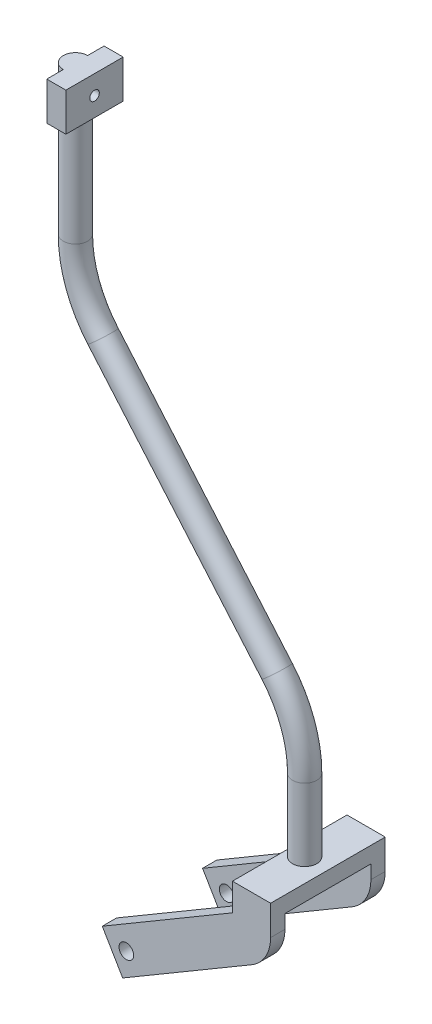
ISO-10303-21;
HEADER;
FILE_DESCRIPTION(('STEP AP214'),'2;1');
FILE_NAME('part.step','',(''),(''),'','','');
FILE_SCHEMA(('AUTOMOTIVE_DESIGN { 1 0 10303 214 1 1 1 1 }'));
ENDSEC;
DATA;
#1=APPLICATION_CONTEXT('core data for automotive mechanical design processes');
#2=APPLICATION_PROTOCOL_DEFINITION('international standard','automotive_design',2000,#1);
#3=PRODUCT_CONTEXT('',#1,'mechanical');
#4=PRODUCT('Part','Part','',(#3));
#5=PRODUCT_RELATED_PRODUCT_CATEGORY('part','',(#4));
#6=PRODUCT_DEFINITION_FORMATION('','',#4);
#7=PRODUCT_DEFINITION_CONTEXT('part definition',#1,'design');
#8=PRODUCT_DEFINITION('design','',#6,#7);
#9=PRODUCT_DEFINITION_SHAPE('','',#8);
#10=(LENGTH_UNIT() NAMED_UNIT(*) SI_UNIT(.MILLI.,.METRE.));
#11=(NAMED_UNIT(*) PLANE_ANGLE_UNIT() SI_UNIT($,.RADIAN.));
#12=(NAMED_UNIT(*) SI_UNIT($,.STERADIAN.) SOLID_ANGLE_UNIT());
#13=UNCERTAINTY_MEASURE_WITH_UNIT(LENGTH_MEASURE(1.E-05),#10,'distance_accuracy_value','');
#14=(GEOMETRIC_REPRESENTATION_CONTEXT(3) GLOBAL_UNCERTAINTY_ASSIGNED_CONTEXT((#13)) GLOBAL_UNIT_ASSIGNED_CONTEXT((#10,
#11,#12)) REPRESENTATION_CONTEXT('',''));
#15=CARTESIAN_POINT('',(0.,0.,0.));
#16=DIRECTION('',(0.,0.,1.));
#17=DIRECTION('',(1.,0.,0.));
#18=AXIS2_PLACEMENT_3D('',#15,#16,#17);
#19=CARTESIAN_POINT('',(0.,-197.623570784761,0.));
#20=DIRECTION('',(0.,1.,0.));
#21=DIRECTION('',(-1.,0.,0.));
#22=AXIS2_PLACEMENT_3D('',#19,#20,#21);
#23=CYLINDRICAL_SURFACE('',#22,16.132175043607);
#24=CARTESIAN_POINT('',(-16.132175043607,-31.75,0.));
#25=CARTESIAN_POINT('',(-16.1321741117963,-31.7499987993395,0.170971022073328));
#26=CARTESIAN_POINT('',(-16.1294496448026,-31.7430859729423,0.34199774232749));
#27=CARTESIAN_POINT('',(-16.1186199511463,-31.7154963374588,0.682840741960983));
#28=CARTESIAN_POINT('',(-16.1105113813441,-31.6948109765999,0.852656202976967));
#29=CARTESIAN_POINT('',(-16.0891075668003,-31.6398279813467,1.19009348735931));
#30=CARTESIAN_POINT('',(-16.0758019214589,-31.6055030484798,1.35771021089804));
#31=CARTESIAN_POINT('',(-16.0443510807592,-31.5235659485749,1.68926495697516));
#32=CARTESIAN_POINT('',(-16.0262039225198,-31.4759483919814,1.85320145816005));
#33=CARTESIAN_POINT('',(-15.9856172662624,-31.3680712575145,2.17564341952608));
#34=CARTESIAN_POINT('',(-15.9631934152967,-31.3078576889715,2.33416626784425));
#35=CARTESIAN_POINT('',(-15.9145667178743,-31.1751772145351,2.64546177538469));
#36=CARTESIAN_POINT('',(-15.8883624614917,-31.1027057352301,2.79823226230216));
#37=CARTESIAN_POINT('',(-15.8328450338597,-30.9461483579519,3.09695913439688));
#38=CARTESIAN_POINT('',(-15.8035341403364,-30.8620709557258,3.24292040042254));
#39=CARTESIAN_POINT('',(-15.7424809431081,-30.682824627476,3.5273985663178));
#40=CARTESIAN_POINT('',(-15.71073776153,-30.5876516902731,3.66591274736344));
#41=CARTESIAN_POINT('',(-15.6442235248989,-30.382664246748,3.94031643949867));
#42=CARTESIAN_POINT('',(-15.6093814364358,-30.2724052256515,4.07585678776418));
#43=CARTESIAN_POINT('',(-15.5387743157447,-30.0412334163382,4.33726865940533));
#44=CARTESIAN_POINT('',(-15.5030092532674,-29.9203202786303,4.46313986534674));
#45=CARTESIAN_POINT('',(-15.4314560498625,-29.668471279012,4.70458302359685));
#46=CARTESIAN_POINT('',(-15.3956679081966,-29.5375293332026,4.82014863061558));
#47=CARTESIAN_POINT('',(-15.3250451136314,-29.2664647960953,5.04017986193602));
#48=CARTESIAN_POINT('',(-15.2902101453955,-29.126345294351,5.1446491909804));
#49=CARTESIAN_POINT('',(-15.2209598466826,-28.8313948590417,5.34614739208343));
#50=CARTESIAN_POINT('',(-15.1866280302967,-28.6761896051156,5.4426580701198));
#51=CARTESIAN_POINT('',(-15.1210992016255,-28.3575928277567,5.62214904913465));
#52=CARTESIAN_POINT('',(-15.089900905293,-28.1942046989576,5.70513490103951));
#53=CARTESIAN_POINT('',(-15.0316419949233,-27.8602277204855,5.85691249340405));
#54=CARTESIAN_POINT('',(-15.0045817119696,-27.689638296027,5.92570309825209));
#55=CARTESIAN_POINT('',(-14.9555541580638,-27.3425543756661,6.04837495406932));
#56=CARTESIAN_POINT('',(-14.9335843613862,-27.1660628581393,6.10226360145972));
#57=CARTESIAN_POINT('',(-14.8963610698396,-26.8162976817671,6.19255834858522));
#58=CARTESIAN_POINT('',(-14.8808554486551,-26.6432219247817,6.22962706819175));
#59=CARTESIAN_POINT('',(-14.8557716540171,-26.2942309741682,6.28921054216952));
#60=CARTESIAN_POINT('',(-14.8461908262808,-26.1183170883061,6.31173181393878));
#61=CARTESIAN_POINT('',(-14.8332956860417,-25.7650263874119,6.34197779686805));
#62=CARTESIAN_POINT('',(-14.8299801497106,-25.5876498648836,6.34970539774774));
#63=CARTESIAN_POINT('',(-14.8297350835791,-25.2328723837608,6.35027802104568));
#64=CARTESIAN_POINT('',(-14.8328052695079,-25.0554714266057,6.34312370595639));
#65=CARTESIAN_POINT('',(-14.8447975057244,-24.7140146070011,6.3150034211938));
#66=CARTESIAN_POINT('',(-14.8533118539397,-24.5498640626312,6.294999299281));
#67=CARTESIAN_POINT('',(-14.8755272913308,-24.2239102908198,6.24232137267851));
#68=CARTESIAN_POINT('',(-14.8892300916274,-24.0621078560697,6.20964338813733));
#69=CARTESIAN_POINT('',(-14.9213971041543,-23.7420271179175,6.13194454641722));
#70=CARTESIAN_POINT('',(-14.9398601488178,-23.5837479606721,6.08692671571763));
#71=CARTESIAN_POINT('',(-14.9810120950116,-23.2715962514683,5.98492859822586));
#72=CARTESIAN_POINT('',(-15.0037026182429,-23.1177254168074,5.92794371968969));
#73=CARTESIAN_POINT('',(-15.0531483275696,-22.8123658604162,5.80125060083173));
#74=CARTESIAN_POINT('',(-15.0799746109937,-22.6609833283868,5.73131438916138));
#75=CARTESIAN_POINT('',(-15.1366179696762,-22.3645746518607,5.57999938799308));
#76=CARTESIAN_POINT('',(-15.1664360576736,-22.2195506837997,5.4986167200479));
#77=CARTESIAN_POINT('',(-15.2282740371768,-21.9366465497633,5.32496331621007));
#78=CARTESIAN_POINT('',(-15.2602942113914,-21.7987673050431,5.23269118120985));
#79=CARTESIAN_POINT('',(-15.3257290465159,-21.5308557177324,5.0378233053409));
#80=CARTESIAN_POINT('',(-15.3591437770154,-21.4008237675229,4.93522704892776));
#81=CARTESIAN_POINT('',(-15.4290855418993,-21.139826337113,4.71222300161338));
#82=CARTESIAN_POINT('',(-15.4656582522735,-21.0095202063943,4.59105672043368));
#83=CARTESIAN_POINT('',(-15.5384773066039,-20.7595255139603,4.33821339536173));
#84=CARTESIAN_POINT('',(-15.574723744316,-20.6398338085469,4.20653948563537));
#85=CARTESIAN_POINT('',(-15.6459563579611,-20.4117006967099,3.93332663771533));
#86=CARTESIAN_POINT('',(-15.6809418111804,-20.3032656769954,3.79178217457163));
#87=CARTESIAN_POINT('',(-15.7486862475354,-20.0985021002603,3.49977229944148));
#88=CARTESIAN_POINT('',(-15.7814461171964,-20.0021687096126,3.34931048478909));
#89=CARTESIAN_POINT('',(-15.8444723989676,-19.8205621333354,3.03736105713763));
#90=CARTESIAN_POINT('',(-15.8746792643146,-19.7355352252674,2.87571778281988));
#91=CARTESIAN_POINT('',(-15.9310141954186,-19.5795246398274,2.54518159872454));
#92=CARTESIAN_POINT('',(-15.9571438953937,-19.5085353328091,2.37629162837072));
#93=CARTESIAN_POINT('',(-16.0045742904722,-19.3812529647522,2.03243349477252));
#94=CARTESIAN_POINT('',(-16.0258758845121,-19.3249571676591,1.85746647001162));
#95=CARTESIAN_POINT('',(-16.0630178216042,-19.227642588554,1.50276972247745));
#96=CARTESIAN_POINT('',(-16.0788585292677,-19.1866227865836,1.3230403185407));
#97=CARTESIAN_POINT('',(-16.1038529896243,-19.1222348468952,0.970750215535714));
#98=CARTESIAN_POINT('',(-16.113339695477,-19.0979851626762,0.798373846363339));
#99=CARTESIAN_POINT('',(-16.1267727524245,-19.0637173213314,0.452000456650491));
#100=CARTESIAN_POINT('',(-16.1307193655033,-19.0536984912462,0.278003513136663));
#101=CARTESIAN_POINT('',(-16.1329616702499,-19.0480013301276,-0.0702234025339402));
#102=CARTESIAN_POINT('',(-16.1312585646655,-19.0523199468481,-0.244453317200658));
#103=CARTESIAN_POINT('',(-16.1222517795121,-19.0752437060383,-0.591822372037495));
#104=CARTESIAN_POINT('',(-16.1149482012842,-19.0938485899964,-0.764961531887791));
#105=CARTESIAN_POINT('',(-16.0953803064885,-19.1440266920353,-1.10133943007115));
#106=CARTESIAN_POINT('',(-16.083345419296,-19.1750010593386,-1.26468138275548));
#107=CARTESIAN_POINT('',(-16.0546370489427,-19.2495542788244,-1.58810136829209));
#108=CARTESIAN_POINT('',(-16.0379620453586,-19.2931372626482,-1.74817831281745));
#109=CARTESIAN_POINT('',(-16.000390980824,-19.3925002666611,-2.06393683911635));
#110=CARTESIAN_POINT('',(-15.9794960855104,-19.448276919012,-2.21961962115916));
#111=CARTESIAN_POINT('',(-15.9339763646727,-19.5715941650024,-2.52575314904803));
#112=CARTESIAN_POINT('',(-15.9093501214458,-19.6391392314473,-2.67620187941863));
#113=CARTESIAN_POINT('',(-15.8561657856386,-19.78765900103,-2.97537364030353));
#114=CARTESIAN_POINT('',(-15.8275120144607,-19.8689753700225,-3.12390999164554));
#115=CARTESIAN_POINT('',(-15.767554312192,-20.0429609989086,-3.41367904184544));
#116=CARTESIAN_POINT('',(-15.7362494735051,-20.1356341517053,-3.5549092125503));
#117=CARTESIAN_POINT('',(-15.6717428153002,-20.3317140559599,-3.82928383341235));
#118=CARTESIAN_POINT('',(-15.6385406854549,-20.435122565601,-3.96242695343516));
#119=CARTESIAN_POINT('',(-15.5710333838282,-20.652039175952,-4.21991824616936));
#120=CARTESIAN_POINT('',(-15.536728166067,-20.7655476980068,-4.34426605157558));
#121=CARTESIAN_POINT('',(-15.4656208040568,-21.0096305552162,-4.59120868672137));
#122=CARTESIAN_POINT('',(-15.4287997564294,-21.1408326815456,-4.71317840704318));
#123=CARTESIAN_POINT('',(-15.3558605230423,-21.4131366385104,-4.94565061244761));
#124=CARTESIAN_POINT('',(-15.3197421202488,-21.5542353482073,-5.05615668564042));
#125=CARTESIAN_POINT('',(-15.2491991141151,-21.8456375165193,-5.26508928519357));
#126=CARTESIAN_POINT('',(-15.2147754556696,-21.9959460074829,-5.36350911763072));
#127=CARTESIAN_POINT('',(-15.1486767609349,-22.304750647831,-5.54745124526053));
#128=CARTESIAN_POINT('',(-15.1170005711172,-22.46324331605,-5.6329789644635));
#129=CARTESIAN_POINT('',(-15.0571098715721,-22.7889051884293,-5.79117729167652));
#130=CARTESIAN_POINT('',(-15.0289276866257,-22.9561376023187,-5.86373024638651));
#131=CARTESIAN_POINT('',(-14.9773060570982,-23.296799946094,-5.99435657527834));
#132=CARTESIAN_POINT('',(-14.9538645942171,-23.4702272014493,-6.05243611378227));
#133=CARTESIAN_POINT('',(-14.9125501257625,-23.8220040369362,-6.15352793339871));
#134=CARTESIAN_POINT('',(-14.8946750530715,-24.0003517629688,-6.19654580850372));
#135=CARTESIAN_POINT('',(-14.8651511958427,-24.3605968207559,-6.26704228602));
#136=CARTESIAN_POINT('',(-14.8535019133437,-24.5424938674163,-6.29452213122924));
#137=CARTESIAN_POINT('',(-14.8374610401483,-24.8954647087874,-6.33223550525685));
#138=CARTESIAN_POINT('',(-14.832618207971,-25.0664040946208,-6.34354230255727));
#139=CARTESIAN_POINT('',(-14.8288693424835,-25.4087003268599,-6.35230122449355));
#140=CARTESIAN_POINT('',(-14.8299630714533,-25.580057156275,-6.34975390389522));
#141=CARTESIAN_POINT('',(-14.8380491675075,-25.9218428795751,-6.3308350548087));
#142=CARTESIAN_POINT('',(-14.8450408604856,-26.0922718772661,-6.3144651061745));
#143=CARTESIAN_POINT('',(-14.8646833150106,-26.4309298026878,-6.26808534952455));
#144=CARTESIAN_POINT('',(-14.877334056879,-26.5991587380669,-6.23807558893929));
#145=CARTESIAN_POINT('',(-14.9073025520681,-26.925970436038,-6.1661056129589));
#146=CARTESIAN_POINT('',(-14.9244283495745,-27.0846788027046,-6.12463359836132));
#147=CARTESIAN_POINT('',(-14.9630313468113,-27.3979779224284,-6.02970881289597));
#148=CARTESIAN_POINT('',(-14.9845099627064,-27.5525673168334,-5.9762521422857));
#149=CARTESIAN_POINT('',(-15.0312066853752,-27.8566581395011,-5.8578105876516));
#150=CARTESIAN_POINT('',(-15.0564242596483,-28.0061602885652,-5.79282734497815));
#151=CARTESIAN_POINT('',(-15.1099230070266,-28.2993116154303,-5.65181241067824));
#152=CARTESIAN_POINT('',(-15.1382052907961,-28.442958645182,-5.57577671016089));
#153=CARTESIAN_POINT('',(-15.2298542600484,-28.8796042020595,-5.32277811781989));
#154=CARTESIAN_POINT('',(-15.2973150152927,-29.1613769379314,-5.12747701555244));
#155=CARTESIAN_POINT('',(-15.4356400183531,-29.6894763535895,-4.69462873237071));
#156=CARTESIAN_POINT('',(-15.5065054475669,-29.9357906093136,-4.45706680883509));
#157=CARTESIAN_POINT('',(-15.6122119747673,-30.281559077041,-4.06519740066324));
#158=CARTESIAN_POINT('',(-15.6483793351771,-30.3957622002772,-3.92401318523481));
#159=CARTESIAN_POINT('',(-15.7187029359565,-30.6118606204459,-3.63207286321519));
#160=CARTESIAN_POINT('',(-15.7528598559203,-30.713760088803,-3.48132002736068));
#161=CARTESIAN_POINT('',(-15.8182297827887,-30.9045306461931,-3.17109198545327));
#162=CARTESIAN_POINT('',(-15.8494415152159,-30.9933961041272,-3.01161305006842));
#163=CARTESIAN_POINT('',(-15.9080222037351,-31.1572961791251,-2.68503374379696));
#164=CARTESIAN_POINT('',(-15.9353916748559,-31.232332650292,-2.51793439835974));
#165=CARTESIAN_POINT('',(-15.9833694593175,-31.3621175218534,-2.19175632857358));
#166=CARTESIAN_POINT('',(-16.004354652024,-31.4180480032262,-2.03320242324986));
#167=CARTESIAN_POINT('',(-16.0419260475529,-31.5172649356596,-1.71168474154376));
#168=CARTESIAN_POINT('',(-16.0585127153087,-31.5605527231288,-1.54872143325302));
#169=CARTESIAN_POINT('',(-16.0868326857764,-31.6340002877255,-1.21986228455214));
#170=CARTESIAN_POINT('',(-16.0985774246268,-31.6641910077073,-1.05397433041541));
#171=CARTESIAN_POINT('',(-16.1169608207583,-31.7112858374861,-0.720111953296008));
#172=CARTESIAN_POINT('',(-16.1236025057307,-31.7281978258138,-0.552138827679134));
#173=CARTESIAN_POINT('',(-16.1291302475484,-31.7422612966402,-0.319877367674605));
#174=CARTESIAN_POINT('',(-16.1302713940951,-31.7451624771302,-0.255945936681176));
#175=CARTESIAN_POINT('',(-16.1317939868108,-31.7490321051,-0.128012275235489));
#176=CARTESIAN_POINT('',(-16.1321753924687,-31.7500004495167,-0.0640100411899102));
#177=CARTESIAN_POINT('',(-16.132175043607,-31.75,0.));
#178=B_SPLINE_CURVE_WITH_KNOTS('',3,(#24,#25,#26,#27,#28,#29,#30,#31,#32,#33,#34,#35,#36,#37,
#38,#39,#40,#41,#42,#43,#44,#45,#46,#47,#48,#49,#50,#51,#52,#53,#54,#55,#56,#57,#58,#59,#60,#61,
#62,#63,#64,#65,#66,#67,#68,#69,#70,#71,#72,#73,#74,#75,#76,#77,#78,#79,#80,#81,#82,#83,#84,#85,
#86,#87,#88,#89,#90,#91,#92,#93,#94,#95,#96,#97,#98,#99,#100,#101,#102,#103,#104,#105,#106,#107,
#108,#109,#110,#111,#112,#113,#114,#115,#116,#117,#118,#119,#120,#121,#122,#123,#124,#125,#126,
#127,#128,#129,#130,#131,#132,#133,#134,#135,#136,#137,#138,#139,#140,#141,#142,#143,#144,#145,
#146,#147,#148,#149,#150,#151,#152,#153,#154,#155,#156,#157,#158,#159,#160,#161,#162,#163,#164,
#165,#166,#167,#168,#169,#170,#171,#172,#173,#174,#175,#176,#177),.UNSPECIFIED.,.T.,.F.,(4,2,2,
2,2,2,2,2,2,2,2,2,2,2,2,2,2,2,2,2,2,2,2,2,2,2,2,2,2,2,2,2,2,2,2,2,2,2,2,2,2,2,2,2,2,2,2,2,2,2,2,
2,2,2,2,2,2,2,2,2,2,2,2,2,2,2,2,2,2,2,2,2,2,2,2,2,4),(0.,0.512849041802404,1.02601682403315,
1.5402168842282,2.05462573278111,2.56718742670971,3.07994078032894,3.59232076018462,
4.10488654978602,4.63878483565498,5.1727006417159,5.70694294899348,6.24100632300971,
6.79819962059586,7.35516365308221,7.91217222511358,8.46890383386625,9.00123897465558,
9.53333545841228,10.0653279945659,10.5972968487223,11.0934670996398,11.5898011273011,
12.0860135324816,12.5824166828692,13.0885722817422,13.5948997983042,14.101292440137,
14.6077103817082,15.1520533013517,15.6962344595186,16.2407227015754,16.7849927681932,
17.3396541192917,17.894092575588,18.4484277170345,19.0027258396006,19.5250575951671,
20.0473646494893,20.5695605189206,21.0917469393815,21.5912353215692,22.0908875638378,
22.590401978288,23.0901066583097,23.6047794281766,24.1196291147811,24.6345632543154,
25.14951888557,25.697536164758,26.24538139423,26.7935286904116,27.3414447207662,
27.8941017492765,28.446522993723,28.9987388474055,29.5509105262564,30.064402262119,
30.5778734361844,31.0912859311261,31.6046966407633,32.0989319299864,32.5933282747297,
33.0876542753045,33.5821600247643,34.6256209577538,35.6694466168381,36.2243525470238,
36.7790698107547,37.3340260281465,37.8889077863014,38.3966442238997,38.9043269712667,
39.4108036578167,39.9169796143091,40.1089755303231,40.3009816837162),.UNSPECIFIED.);
#179=CARTESIAN_POINT('',(-16.132175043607,-31.75,0.));
#180=VERTEX_POINT('',#179);
#181=EDGE_CURVE('E192',#180,#180,#178,.T.);
#182=ORIENTED_EDGE('',*,*,#181,.F.);
#183=EDGE_LOOP('',(#182));
#184=FACE_BOUND('',#183,.T.);
#185=CARTESIAN_POINT('',(0.,-197.623570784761,0.));
#186=DIRECTION('',(0.,1.,0.));
#187=DIRECTION('',(0.,0.,1.));
#188=AXIS2_PLACEMENT_3D('',#185,#186,#187);
#189=CIRCLE('',#188,16.132175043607);
#190=CARTESIAN_POINT('',(-16.1321750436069,-197.623570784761,0.));
#191=VERTEX_POINT('',#190);
#192=EDGE_CURVE('E334',#191,#191,#189,.T.);
#193=ORIENTED_EDGE('',*,*,#192,.T.);
#194=EDGE_LOOP('',(#193));
#195=FACE_BOUND('',#194,.T.);
#196=CARTESIAN_POINT('',(0.,0.,0.));
#197=DIRECTION('',(0.,1.,0.));
#198=DIRECTION('',(0.,0.,1.));
#199=AXIS2_PLACEMENT_3D('',#196,#197,#198);
#200=CIRCLE('',#199,16.132175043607);
#201=CARTESIAN_POINT('',(0.,0.,-16.132175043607));
#202=VERTEX_POINT('',#201);
#203=CARTESIAN_POINT('',(0.,0.,16.132175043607));
#204=VERTEX_POINT('',#203);
#205=EDGE_CURVE('E331',#202,#204,#200,.T.);
#206=ORIENTED_EDGE('',*,*,#205,.F.);
#207=DIRECTION('',(0.,1.,0.));
#208=VECTOR('',#207,1.);
#209=CARTESIAN_POINT('',(0.,-197.623570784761,-16.132175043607));
#210=LINE('',#209,#208);
#211=CARTESIAN_POINT('',(0.,-50.8,-16.132175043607));
#212=VERTEX_POINT('',#211);
#213=EDGE_CURVE('E221',#202,#212,#210,.F.);
#214=ORIENTED_EDGE('',*,*,#213,.T.);
#215=CARTESIAN_POINT('',(0.,-50.8,0.));
#216=DIRECTION('',(0.,1.,0.));
#217=DIRECTION('',(0.,0.,1.));
#218=AXIS2_PLACEMENT_3D('',#215,#216,#217);
#219=CIRCLE('',#218,16.132175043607);
#220=CARTESIAN_POINT('',(0.,-50.8,16.132175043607));
#221=VERTEX_POINT('',#220);
#222=EDGE_CURVE('E11',#212,#221,#219,.F.);
#223=ORIENTED_EDGE('',*,*,#222,.T.);
#224=DIRECTION('',(0.,1.,0.));
#225=VECTOR('',#224,1.);
#226=CARTESIAN_POINT('',(0.,-197.623570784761,16.132175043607));
#227=LINE('',#226,#225);
#228=EDGE_CURVE('E173',#221,#204,#227,.T.);
#229=ORIENTED_EDGE('',*,*,#228,.T.);
#230=EDGE_LOOP('',(#206,#214,#223,#229));
#231=FACE_BOUND('',#230,.T.);
#232=ADVANCED_FACE('F33',(#184,#195,#231),#23,.T.);
#233=CARTESIAN_POINT('',(284.899081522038,-798.47194558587,76.2));
#234=DIRECTION('',(-0.507484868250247,0.86166066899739,0.));
#235=DIRECTION('',(-0.86166066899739,-0.507484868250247,0.));
#236=AXIS2_PLACEMENT_3D('',#233,#234,#235);
#237=PLANE('',#236);
#238=DIRECTION('',(0.86166066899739,0.507484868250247,0.));
#239=VECTOR('',#238,1.);
#240=CARTESIAN_POINT('',(284.899081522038,-798.47194558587,57.15));
#241=LINE('',#240,#239);
#242=CARTESIAN_POINT('',(111.878780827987,-900.374222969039,57.15));
#243=VERTEX_POINT('',#242);
#244=CARTESIAN_POINT('',(284.899081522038,-798.47194558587,57.15));
#245=VERTEX_POINT('',#244);
#246=EDGE_CURVE('E254',#243,#245,#241,.T.);
#247=ORIENTED_EDGE('',*,*,#246,.F.);
#248=DIRECTION('',(0.,0.,-1.));
#249=VECTOR('',#248,1.);
#250=CARTESIAN_POINT('',(111.878780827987,-900.374222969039,76.2));
#251=LINE('',#250,#249);
#252=CARTESIAN_POINT('',(111.878780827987,-900.374222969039,76.2));
#253=VERTEX_POINT('',#252);
#254=EDGE_CURVE('E295',#253,#243,#251,.T.);
#255=ORIENTED_EDGE('',*,*,#254,.F.);
#256=DIRECTION('',(0.86166066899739,0.507484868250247,0.));
#257=VECTOR('',#256,1.);
#258=CARTESIAN_POINT('',(284.899081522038,-798.47194558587,76.2));
#259=LINE('',#258,#257);
#260=CARTESIAN_POINT('',(284.899081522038,-798.47194558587,76.2));
#261=VERTEX_POINT('',#260);
#262=EDGE_CURVE('E286',#253,#261,#259,.T.);
#263=ORIENTED_EDGE('',*,*,#262,.T.);
#264=DIRECTION('',(0.,0.,-1.));
#265=VECTOR('',#264,1.);
#266=CARTESIAN_POINT('',(284.899081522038,-798.47194558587,76.2));
#267=LINE('',#266,#265);
#268=EDGE_CURVE('E290',#261,#245,#267,.T.);
#269=ORIENTED_EDGE('',*,*,#268,.T.);
#270=EDGE_LOOP('',(#247,#255,#263,#269));
#271=FACE_BOUND('',#270,.T.);
#272=ADVANCED_FACE('F389',(#271),#237,.T.);
#273=CARTESIAN_POINT('',(111.878780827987,-900.374222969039,76.2));
#274=DIRECTION('',(-0.86166066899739,-0.507484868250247,0.));
#275=DIRECTION('',(0.507484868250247,-0.86166066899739,0.));
#276=AXIS2_PLACEMENT_3D('',#273,#274,#275);
#277=PLANE('',#276);
#278=DIRECTION('',(-0.507484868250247,0.86166066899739,0.));
#279=VECTOR('',#278,1.);
#280=CARTESIAN_POINT('',(111.878780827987,-900.374222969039,57.15));
#281=LINE('',#280,#279);
#282=CARTESIAN_POINT('',(139.01755151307,-946.453254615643,57.15));
#283=VERTEX_POINT('',#282);
#284=EDGE_CURVE('E252',#283,#243,#281,.T.);
#285=ORIENTED_EDGE('',*,*,#284,.F.);
#286=DIRECTION('',(0.,0.,-1.));
#287=VECTOR('',#286,1.);
#288=CARTESIAN_POINT('',(139.01755151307,-946.453254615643,76.2));
#289=LINE('',#288,#287);
#290=CARTESIAN_POINT('',(139.01755151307,-946.453254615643,76.2));
#291=VERTEX_POINT('',#290);
#292=EDGE_CURVE('E299',#291,#283,#289,.T.);
#293=ORIENTED_EDGE('',*,*,#292,.F.);
#294=DIRECTION('',(-0.507484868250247,0.86166066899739,0.));
#295=VECTOR('',#294,1.);
#296=CARTESIAN_POINT('',(111.878780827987,-900.374222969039,76.2));
#297=LINE('',#296,#295);
#298=EDGE_CURVE('E283',#291,#253,#297,.T.);
#299=ORIENTED_EDGE('',*,*,#298,.T.);
#300=ORIENTED_EDGE('',*,*,#254,.T.);
#301=EDGE_LOOP('',(#285,#293,#299,#300));
#302=FACE_BOUND('',#301,.T.);
#303=ADVANCED_FACE('F386',(#302),#277,.T.);
#304=CARTESIAN_POINT('',(310.67931282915,-845.351104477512,76.2));
#305=DIRECTION('',(0.507484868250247,-0.86166066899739,0.));
#306=DIRECTION('',(0.86166066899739,0.507484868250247,0.));
#307=AXIS2_PLACEMENT_3D('',#304,#305,#306);
#308=PLANE('',#307);
#309=DIRECTION('',(-0.86166066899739,-0.507484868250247,0.));
#310=VECTOR('',#309,1.);
#311=CARTESIAN_POINT('',(310.67931282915,-845.351104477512,57.15));
#312=LINE('',#311,#310);
#313=CARTESIAN_POINT('',(310.67931282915,-845.351104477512,57.15));
#314=VERTEX_POINT('',#313);
#315=EDGE_CURVE('E250',#314,#283,#312,.T.);
#316=ORIENTED_EDGE('',*,*,#315,.F.);
#317=DIRECTION('',(0.,0.,-1.));
#318=VECTOR('',#317,1.);
#319=CARTESIAN_POINT('',(310.67931282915,-845.351104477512,76.2));
#320=LINE('',#319,#318);
#321=CARTESIAN_POINT('',(310.67931282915,-845.351104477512,76.2));
#322=VERTEX_POINT('',#321);
#323=EDGE_CURVE('E303',#322,#314,#320,.T.);
#324=ORIENTED_EDGE('',*,*,#323,.F.);
#325=DIRECTION('',(-0.86166066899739,-0.507484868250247,0.));
#326=VECTOR('',#325,1.);
#327=CARTESIAN_POINT('',(310.67931282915,-845.351104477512,76.2));
#328=LINE('',#327,#326);
#329=EDGE_CURVE('E280',#322,#291,#328,.T.);
#330=ORIENTED_EDGE('',*,*,#329,.T.);
#331=ORIENTED_EDGE('',*,*,#292,.T.);
#332=EDGE_LOOP('',(#316,#324,#330,#331));
#333=FACE_BOUND('',#332,.T.);
#334=ADVANCED_FACE('F378',(#333),#308,.T.);
#335=CARTESIAN_POINT('',(284.899081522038,-801.578742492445,76.2));
#336=DIRECTION('',(0.,0.,-1.));
#337=DIRECTION('',(-1.,0.,0.));
#338=AXIS2_PLACEMENT_3D('',#335,#336,#337);
#339=CYLINDRICAL_SURFACE('',#338,50.8);
#340=CARTESIAN_POINT('',(284.899081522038,-801.578742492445,57.15));
#341=DIRECTION('',(0.,0.,1.));
#342=DIRECTION('',(1.,0.,0.));
#343=AXIS2_PLACEMENT_3D('',#340,#341,#342);
#344=CIRCLE('',#343,50.8);
#345=CARTESIAN_POINT('',(335.699081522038,-801.578742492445,57.15));
#346=VERTEX_POINT('',#345);
#347=EDGE_CURVE('E248',#346,#314,#344,.F.);
#348=ORIENTED_EDGE('',*,*,#347,.F.);
#349=DIRECTION('',(0.,0.,-1.));
#350=VECTOR('',#349,1.);
#351=CARTESIAN_POINT('',(335.699081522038,-801.578742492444,76.2));
#352=LINE('',#351,#350);
#353=CARTESIAN_POINT('',(335.699081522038,-801.578742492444,76.2));
#354=VERTEX_POINT('',#353);
#355=EDGE_CURVE('E307',#354,#346,#352,.T.);
#356=ORIENTED_EDGE('',*,*,#355,.F.);
#357=CARTESIAN_POINT('',(284.899081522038,-801.578742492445,76.2));
#358=DIRECTION('',(0.,0.,-1.));
#359=DIRECTION('',(1.,0.,0.));
#360=AXIS2_PLACEMENT_3D('',#357,#358,#359);
#361=CIRCLE('',#360,50.8);
#362=EDGE_CURVE('E277',#354,#322,#361,.T.);
#363=ORIENTED_EDGE('',*,*,#362,.T.);
#364=ORIENTED_EDGE('',*,*,#323,.T.);
#365=EDGE_LOOP('',(#348,#356,#363,#364));
#366=FACE_BOUND('',#365,.T.);
#367=ADVANCED_FACE('F374',(#366),#339,.T.);
#368=CARTESIAN_POINT('',(143.869397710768,-913.074222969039,76.2));
#369=DIRECTION('',(0.,0.,-1.));
#370=DIRECTION('',(-1.,0.,0.));
#371=AXIS2_PLACEMENT_3D('',#368,#369,#370);
#372=CYLINDRICAL_SURFACE('',#371,9.70369239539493);
#373=CARTESIAN_POINT('',(143.869397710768,-913.074222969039,57.15));
#374=DIRECTION('',(0.,0.,1.));
#375=DIRECTION('',(1.,0.,0.));
#376=AXIS2_PLACEMENT_3D('',#373,#374,#375);
#377=CIRCLE('',#376,9.70369239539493);
#378=CARTESIAN_POINT('',(153.573090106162,-913.074222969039,57.15));
#379=VERTEX_POINT('',#378);
#380=EDGE_CURVE('E247',#379,#379,#377,.F.);
#381=ORIENTED_EDGE('',*,*,#380,.T.);
#382=EDGE_LOOP('',(#381));
#383=FACE_BOUND('',#382,.T.);
#384=CARTESIAN_POINT('',(143.869397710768,-913.074222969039,76.2));
#385=DIRECTION('',(0.,0.,-1.));
#386=DIRECTION('',(-1.,0.,0.));
#387=AXIS2_PLACEMENT_3D('',#384,#385,#386);
#388=CIRCLE('',#387,9.70369239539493);
#389=CARTESIAN_POINT('',(134.165705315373,-913.074222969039,76.2));
#390=VERTEX_POINT('',#389);
#391=EDGE_CURVE('E262',#390,#390,#388,.T.);
#392=ORIENTED_EDGE('',*,*,#391,.F.);
#393=EDGE_LOOP('',(#392));
#394=FACE_BOUND('',#393,.T.);
#395=ADVANCED_FACE('F451',(#383,#394),#372,.F.);
#396=CARTESIAN_POINT('',(304.8,-665.976429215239,0.));
#397=DIRECTION('',(0.,-1.,0.));
#398=DIRECTION('',(1.,0.,0.));
#399=AXIS2_PLACEMENT_3D('',#396,#397,#398);
#400=CYLINDRICAL_SURFACE('',#399,16.132175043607);
#401=CARTESIAN_POINT('',(304.8,-665.976429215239,0.));
#402=DIRECTION('',(0.,1.,0.));
#403=DIRECTION('',(0.,0.,1.));
#404=AXIS2_PLACEMENT_3D('',#401,#402,#403);
#405=CIRCLE('',#404,16.132175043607);
#406=CARTESIAN_POINT('',(320.932175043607,-665.976429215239,0.));
#407=VERTEX_POINT('',#406);
#408=EDGE_CURVE('E343',#407,#407,#405,.T.);
#409=ORIENTED_EDGE('',*,*,#408,.F.);
#410=EDGE_LOOP('',(#409));
#411=FACE_BOUND('',#410,.T.);
#412=CARTESIAN_POINT('',(304.8,-762.,0.));
#413=DIRECTION('',(0.,1.,0.));
#414=DIRECTION('',(0.,0.,1.));
#415=AXIS2_PLACEMENT_3D('',#412,#413,#414);
#416=CIRCLE('',#415,16.132175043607);
#417=CARTESIAN_POINT('',(304.8,-762.,16.132175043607));
#418=VERTEX_POINT('',#417);
#419=EDGE_CURVE('E330',#418,#418,#416,.T.);
#420=ORIENTED_EDGE('',*,*,#419,.T.);
#421=EDGE_LOOP('',(#420));
#422=FACE_BOUND('',#421,.T.);
#423=ADVANCED_FACE('F35',(#411,#422),#400,.T.);
#424=CARTESIAN_POINT('',(152.4,-665.976429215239,0.));
#425=DIRECTION('',(0.,0.,-1.));
#426=DIRECTION('',(-1.,0.,0.));
#427=AXIS2_PLACEMENT_3D('',#424,#425,#426);
#428=TOROIDAL_SURFACE('',#427,152.4,16.132175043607);
#429=CARTESIAN_POINT('',(268.110706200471,-566.79582390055,0.));
#430=DIRECTION('',(-0.650791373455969,0.759256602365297,0.));
#431=DIRECTION('',(0.,0.,1.));
#432=AXIS2_PLACEMENT_3D('',#429,#430,#431);
#433=CIRCLE('',#432,16.132175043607);
#434=CARTESIAN_POINT('',(280.359166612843,-556.297143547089,0.));
#435=VERTEX_POINT('',#434);
#436=EDGE_CURVE('E340',#435,#435,#433,.T.);
#437=CARTESIAN_POINT('',(152.4,-665.976429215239,0.));
#438=DIRECTION('',(0.,0.,-1.));
#439=DIRECTION('',(-1.,0.,0.));
#440=AXIS2_PLACEMENT_3D('',#437,#438,#439);
#441=CIRCLE('',#440,168.532175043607);
#442=EDGE_CURVE('',#435,#407,#441,.T.);
#443=ORIENTED_EDGE('',*,*,#436,.F.);
#444=ORIENTED_EDGE('',*,*,#408,.T.);
#445=ORIENTED_EDGE('',*,*,#442,.T.);
#446=ORIENTED_EDGE('',*,*,#442,.F.);
#447=EDGE_LOOP('',(#443,#445,#444,#446));
#448=FACE_BOUND('',#447,.T.);
#449=ADVANCED_FACE('F444',(#448),#428,.T.);
#450=CARTESIAN_POINT('',(36.6892937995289,-296.80417609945,0.));
#451=DIRECTION('',(0.650791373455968,-0.759256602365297,0.));
#452=DIRECTION('',(0.759256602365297,0.650791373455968,0.));
#453=AXIS2_PLACEMENT_3D('',#450,#451,#452);
#454=CYLINDRICAL_SURFACE('',#453,16.132175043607);
#455=CARTESIAN_POINT('',(36.6892937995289,-296.80417609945,0.));
#456=DIRECTION('',(-0.650791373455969,0.759256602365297,0.));
#457=DIRECTION('',(0.,0.,1.));
#458=AXIS2_PLACEMENT_3D('',#455,#456,#457);
#459=CIRCLE('',#458,16.132175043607);
#460=CARTESIAN_POINT('',(24.4408333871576,-307.302856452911,0.));
#461=VERTEX_POINT('',#460);
#462=EDGE_CURVE('E337',#461,#461,#459,.T.);
#463=ORIENTED_EDGE('',*,*,#462,.F.);
#464=EDGE_LOOP('',(#463));
#465=FACE_BOUND('',#464,.T.);
#466=ORIENTED_EDGE('',*,*,#436,.T.);
#467=EDGE_LOOP('',(#466));
#468=FACE_BOUND('',#467,.T.);
#469=ADVANCED_FACE('F441',(#465,#468),#454,.T.);
#470=CARTESIAN_POINT('',(152.4,-197.623570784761,0.));
#471=DIRECTION('',(0.,0.,1.));
#472=DIRECTION('',(1.,0.,0.));
#473=AXIS2_PLACEMENT_3D('',#470,#471,#472);
#474=TOROIDAL_SURFACE('',#473,152.4,16.132175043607);
#475=CARTESIAN_POINT('',(152.4,-197.623570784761,0.));
#476=DIRECTION('',(0.,0.,1.));
#477=DIRECTION('',(1.,0.,0.));
#478=AXIS2_PLACEMENT_3D('',#475,#476,#477);
#479=CIRCLE('',#478,168.532175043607);
#480=EDGE_CURVE('',#191,#461,#479,.T.);
#481=ORIENTED_EDGE('',*,*,#192,.F.);
#482=ORIENTED_EDGE('',*,*,#462,.T.);
#483=ORIENTED_EDGE('',*,*,#480,.T.);
#484=ORIENTED_EDGE('',*,*,#480,.F.);
#485=EDGE_LOOP('',(#481,#483,#482,#484));
#486=FACE_BOUND('',#485,.T.);
#487=ADVANCED_FACE('F438',(#486),#474,.T.);
#488=CARTESIAN_POINT('',(0.,0.,0.));
#489=DIRECTION('',(0.,1.,0.));
#490=DIRECTION('',(0.,0.,1.));
#491=AXIS2_PLACEMENT_3D('',#488,#489,#490);
#492=PLANE('',#491);
#493=ORIENTED_EDGE('',*,*,#205,.T.);
#494=DIRECTION('',(0.,0.,1.));
#495=VECTOR('',#494,1.);
#496=CARTESIAN_POINT('',(0.,0.,38.1));
#497=LINE('',#496,#495);
#498=CARTESIAN_POINT('',(0.,0.,38.1));
#499=VERTEX_POINT('',#498);
#500=EDGE_CURVE('E48',#204,#499,#497,.T.);
#501=ORIENTED_EDGE('',*,*,#500,.T.);
#502=DIRECTION('',(-1.,0.,0.));
#503=VECTOR('',#502,1.);
#504=CARTESIAN_POINT('',(25.4,0.,38.1));
#505=LINE('',#504,#503);
#506=CARTESIAN_POINT('',(25.4,0.,38.1));
#507=VERTEX_POINT('',#506);
#508=EDGE_CURVE('E191',#507,#499,#505,.T.);
#509=ORIENTED_EDGE('',*,*,#508,.F.);
#510=DIRECTION('',(0.,0.,1.));
#511=VECTOR('',#510,1.);
#512=CARTESIAN_POINT('',(25.4,0.,38.1));
#513=LINE('',#512,#511);
#514=CARTESIAN_POINT('',(25.4,0.,-38.1));
#515=VERTEX_POINT('',#514);
#516=EDGE_CURVE('E212',#515,#507,#513,.T.);
#517=ORIENTED_EDGE('',*,*,#516,.F.);
#518=DIRECTION('',(-1.,0.,0.));
#519=VECTOR('',#518,1.);
#520=CARTESIAN_POINT('',(25.4,0.,-38.1));
#521=LINE('',#520,#519);
#522=CARTESIAN_POINT('',(0.,0.,-38.1));
#523=VERTEX_POINT('',#522);
#524=EDGE_CURVE('E215',#515,#523,#521,.T.);
#525=ORIENTED_EDGE('',*,*,#524,.T.);
#526=EDGE_CURVE('E204',#523,#202,#497,.T.);
#527=ORIENTED_EDGE('',*,*,#526,.T.);
#528=EDGE_LOOP('',(#493,#501,#509,#517,#525,#527));
#529=FACE_BOUND('',#528,.T.);
#530=ADVANCED_FACE('F436',(#529),#492,.T.);
#531=CARTESIAN_POINT('',(335.699081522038,-762.,-76.2));
#532=DIRECTION('',(0.,1.,0.));
#533=DIRECTION('',(0.,0.,1.));
#534=AXIS2_PLACEMENT_3D('',#531,#532,#533);
#535=PLANE('',#534);
#536=DIRECTION('',(0.,0.,1.));
#537=VECTOR('',#536,1.);
#538=CARTESIAN_POINT('',(335.699081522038,-762.,76.2));
#539=LINE('',#538,#537);
#540=CARTESIAN_POINT('',(335.699081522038,-762.,-76.2));
#541=VERTEX_POINT('',#540);
#542=CARTESIAN_POINT('',(335.699081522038,-762.,76.2));
#543=VERTEX_POINT('',#542);
#544=EDGE_CURVE('E293',#541,#543,#539,.T.);
#545=ORIENTED_EDGE('',*,*,#544,.F.);
#546=DIRECTION('',(1.,0.,0.));
#547=VECTOR('',#546,1.);
#548=CARTESIAN_POINT('',(335.699081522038,-762.,-76.2));
#549=LINE('',#548,#547);
#550=CARTESIAN_POINT('',(284.899081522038,-762.,-76.2));
#551=VERTEX_POINT('',#550);
#552=EDGE_CURVE('E316',#551,#541,#549,.T.);
#553=ORIENTED_EDGE('',*,*,#552,.F.);
#554=DIRECTION('',(0.,0.,-1.));
#555=VECTOR('',#554,1.);
#556=CARTESIAN_POINT('',(284.899081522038,-762.,76.2));
#557=LINE('',#556,#555);
#558=CARTESIAN_POINT('',(284.899081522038,-762.,76.2));
#559=VERTEX_POINT('',#558);
#560=EDGE_CURVE('E314',#559,#551,#557,.T.);
#561=ORIENTED_EDGE('',*,*,#560,.F.);
#562=DIRECTION('',(-1.,0.,0.));
#563=VECTOR('',#562,1.);
#564=CARTESIAN_POINT('',(335.699081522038,-762.,76.2));
#565=LINE('',#564,#563);
#566=EDGE_CURVE('E312',#543,#559,#565,.T.);
#567=ORIENTED_EDGE('',*,*,#566,.F.);
#568=EDGE_LOOP('',(#545,#553,#561,#567));
#569=FACE_BOUND('',#568,.T.);
#570=ORIENTED_EDGE('',*,*,#419,.F.);
#571=EDGE_LOOP('',(#570));
#572=FACE_BOUND('',#571,.T.);
#573=ADVANCED_FACE('F395',(#569,#572),#535,.T.);
#574=CARTESIAN_POINT('',(335.699081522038,-774.7,76.2));
#575=DIRECTION('',(-1.,0.,0.));
#576=DIRECTION('',(0.,-1.,0.));
#577=AXIS2_PLACEMENT_3D('',#574,#575,#576);
#578=PLANE('',#577);
#579=ORIENTED_EDGE('',*,*,#355,.T.);
#580=DIRECTION('',(0.,-1.,0.));
#581=VECTOR('',#580,1.);
#582=CARTESIAN_POINT('',(335.699081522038,-946.453254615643,57.15));
#583=LINE('',#582,#581);
#584=CARTESIAN_POINT('',(335.699081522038,-783.415144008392,57.15));
#585=VERTEX_POINT('',#584);
#586=EDGE_CURVE('E224',#585,#346,#583,.T.);
#587=ORIENTED_EDGE('',*,*,#586,.F.);
#588=DIRECTION('',(0.,0.,1.));
#589=VECTOR('',#588,1.);
#590=CARTESIAN_POINT('',(335.699081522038,-783.415144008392,57.15));
#591=LINE('',#590,#589);
#592=CARTESIAN_POINT('',(335.699081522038,-783.415144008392,-57.15));
#593=VERTEX_POINT('',#592);
#594=EDGE_CURVE('E229',#593,#585,#591,.T.);
#595=ORIENTED_EDGE('',*,*,#594,.F.);
#596=DIRECTION('',(0.,1.,0.));
#597=VECTOR('',#596,1.);
#598=CARTESIAN_POINT('',(335.699081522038,-946.453254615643,-57.15));
#599=LINE('',#598,#597);
#600=CARTESIAN_POINT('',(335.699081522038,-801.578742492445,-57.15));
#601=VERTEX_POINT('',#600);
#602=EDGE_CURVE('E226',#601,#593,#599,.T.);
#603=ORIENTED_EDGE('',*,*,#602,.F.);
#604=CARTESIAN_POINT('',(335.699081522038,-801.578742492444,-76.2));
#605=VERTEX_POINT('',#604);
#606=EDGE_CURVE('E289',#601,#605,#352,.T.);
#607=ORIENTED_EDGE('',*,*,#606,.T.);
#608=DIRECTION('',(0.,1.,0.));
#609=VECTOR('',#608,1.);
#610=CARTESIAN_POINT('',(335.699081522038,-774.7,-76.2));
#611=LINE('',#610,#609);
#612=EDGE_CURVE('E318',#605,#541,#611,.T.);
#613=ORIENTED_EDGE('',*,*,#612,.T.);
#614=ORIENTED_EDGE('',*,*,#544,.T.);
#615=DIRECTION('',(0.,1.,0.));
#616=VECTOR('',#615,1.);
#617=CARTESIAN_POINT('',(335.699081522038,-774.7,76.2));
#618=LINE('',#617,#616);
#619=EDGE_CURVE('E327',#354,#543,#618,.T.);
#620=ORIENTED_EDGE('',*,*,#619,.F.);
#621=EDGE_LOOP('',(#579,#587,#595,#603,#607,#613,#614,#620));
#622=FACE_BOUND('',#621,.T.);
#623=ADVANCED_FACE('F367',(#622),#578,.F.);
#624=CARTESIAN_POINT('',(335.699081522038,-774.7,76.2));
#625=DIRECTION('',(0.,0.,-1.));
#626=DIRECTION('',(-1.,0.,0.));
#627=AXIS2_PLACEMENT_3D('',#624,#625,#626);
#628=PLANE('',#627);
#629=ORIENTED_EDGE('',*,*,#566,.T.);
#630=DIRECTION('',(0.,1.,0.));
#631=VECTOR('',#630,1.);
#632=CARTESIAN_POINT('',(284.899081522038,-774.7,76.2));
#633=LINE('',#632,#631);
#634=EDGE_CURVE('E324',#261,#559,#633,.T.);
#635=ORIENTED_EDGE('',*,*,#634,.F.);
#636=ORIENTED_EDGE('',*,*,#262,.F.);
#637=ORIENTED_EDGE('',*,*,#298,.F.);
#638=ORIENTED_EDGE('',*,*,#329,.F.);
#639=ORIENTED_EDGE('',*,*,#362,.F.);
#640=ORIENTED_EDGE('',*,*,#619,.T.);
#641=EDGE_LOOP('',(#629,#635,#636,#637,#638,#639,#640));
#642=FACE_BOUND('',#641,.T.);
#643=ORIENTED_EDGE('',*,*,#391,.T.);
#644=EDGE_LOOP('',(#643));
#645=FACE_BOUND('',#644,.T.);
#646=ADVANCED_FACE('F381',(#642,#645),#628,.F.);
#647=CARTESIAN_POINT('',(284.899081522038,-774.7,76.2));
#648=DIRECTION('',(1.,0.,0.));
#649=DIRECTION('',(0.,1.,0.));
#650=AXIS2_PLACEMENT_3D('',#647,#648,#649);
#651=PLANE('',#650);
#652=DIRECTION('',(0.,0.,1.));
#653=VECTOR('',#652,1.);
#654=CARTESIAN_POINT('',(284.899081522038,-783.415144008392,76.2));
#655=LINE('',#654,#653);
#656=CARTESIAN_POINT('',(284.899081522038,-783.415144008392,-57.15));
#657=VERTEX_POINT('',#656);
#658=CARTESIAN_POINT('',(284.899081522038,-783.415144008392,57.15));
#659=VERTEX_POINT('',#658);
#660=EDGE_CURVE('E41',#657,#659,#655,.T.);
#661=ORIENTED_EDGE('',*,*,#660,.T.);
#662=DIRECTION('',(0.,-1.,0.));
#663=VECTOR('',#662,1.);
#664=CARTESIAN_POINT('',(284.899081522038,-774.7,57.15));
#665=LINE('',#664,#663);
#666=EDGE_CURVE('E256',#659,#245,#665,.T.);
#667=ORIENTED_EDGE('',*,*,#666,.T.);
#668=ORIENTED_EDGE('',*,*,#268,.F.);
#669=ORIENTED_EDGE('',*,*,#634,.T.);
#670=ORIENTED_EDGE('',*,*,#560,.T.);
#671=DIRECTION('',(0.,1.,0.));
#672=VECTOR('',#671,1.);
#673=CARTESIAN_POINT('',(284.899081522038,-774.7,-76.2));
#674=LINE('',#673,#672);
#675=CARTESIAN_POINT('',(284.899081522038,-798.47194558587,-76.2));
#676=VERTEX_POINT('',#675);
#677=EDGE_CURVE('E321',#676,#551,#674,.T.);
#678=ORIENTED_EDGE('',*,*,#677,.F.);
#679=CARTESIAN_POINT('',(284.899081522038,-798.47194558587,-57.15));
#680=VERTEX_POINT('',#679);
#681=EDGE_CURVE('E294',#680,#676,#267,.T.);
#682=ORIENTED_EDGE('',*,*,#681,.F.);
#683=DIRECTION('',(0.,1.,0.));
#684=VECTOR('',#683,1.);
#685=CARTESIAN_POINT('',(284.899081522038,-774.7,-57.15));
#686=LINE('',#685,#684);
#687=EDGE_CURVE('E244',#680,#657,#686,.T.);
#688=ORIENTED_EDGE('',*,*,#687,.T.);
#689=EDGE_LOOP('',(#661,#667,#668,#669,#670,#678,#682,#688));
#690=FACE_BOUND('',#689,.T.);
#691=ADVANCED_FACE('F353',(#690),#651,.F.);
#692=CARTESIAN_POINT('',(335.699081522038,-774.7,-76.2));
#693=DIRECTION('',(0.,0.,1.));
#694=DIRECTION('',(1.,0.,0.));
#695=AXIS2_PLACEMENT_3D('',#692,#693,#694);
#696=PLANE('',#695);
#697=ORIENTED_EDGE('',*,*,#552,.T.);
#698=ORIENTED_EDGE('',*,*,#612,.F.);
#699=CARTESIAN_POINT('',(284.899081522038,-801.578742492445,-76.2));
#700=DIRECTION('',(0.,0.,-1.));
#701=DIRECTION('',(1.,0.,0.));
#702=AXIS2_PLACEMENT_3D('',#699,#700,#701);
#703=CIRCLE('',#702,50.8);
#704=CARTESIAN_POINT('',(310.67931282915,-845.351104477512,-76.2));
#705=VERTEX_POINT('',#704);
#706=EDGE_CURVE('E265',#605,#705,#703,.T.);
#707=ORIENTED_EDGE('',*,*,#706,.T.);
#708=DIRECTION('',(-0.86166066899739,-0.507484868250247,0.));
#709=VECTOR('',#708,1.);
#710=CARTESIAN_POINT('',(310.67931282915,-845.351104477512,-76.2));
#711=LINE('',#710,#709);
#712=CARTESIAN_POINT('',(139.01755151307,-946.453254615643,-76.2));
#713=VERTEX_POINT('',#712);
#714=EDGE_CURVE('E268',#705,#713,#711,.T.);
#715=ORIENTED_EDGE('',*,*,#714,.T.);
#716=DIRECTION('',(-0.507484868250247,0.86166066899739,0.));
#717=VECTOR('',#716,1.);
#718=CARTESIAN_POINT('',(111.878780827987,-900.374222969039,-76.2));
#719=LINE('',#718,#717);
#720=CARTESIAN_POINT('',(111.878780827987,-900.374222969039,-76.2));
#721=VERTEX_POINT('',#720);
#722=EDGE_CURVE('E271',#713,#721,#719,.T.);
#723=ORIENTED_EDGE('',*,*,#722,.T.);
#724=DIRECTION('',(0.86166066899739,0.507484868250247,0.));
#725=VECTOR('',#724,1.);
#726=CARTESIAN_POINT('',(284.899081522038,-798.47194558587,-76.2));
#727=LINE('',#726,#725);
#728=EDGE_CURVE('E274',#721,#676,#727,.T.);
#729=ORIENTED_EDGE('',*,*,#728,.T.);
#730=ORIENTED_EDGE('',*,*,#677,.T.);
#731=EDGE_LOOP('',(#697,#698,#707,#715,#723,#729,#730));
#732=FACE_BOUND('',#731,.T.);
#733=CARTESIAN_POINT('',(143.869397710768,-913.074222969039,-76.2));
#734=DIRECTION('',(0.,0.,-1.));
#735=DIRECTION('',(-1.,0.,0.));
#736=AXIS2_PLACEMENT_3D('',#733,#734,#735);
#737=CIRCLE('',#736,9.70369239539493);
#738=CARTESIAN_POINT('',(134.165705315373,-913.074222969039,-76.2));
#739=VERTEX_POINT('',#738);
#740=EDGE_CURVE('E259',#739,#739,#737,.T.);
#741=ORIENTED_EDGE('',*,*,#740,.F.);
#742=EDGE_LOOP('',(#741));
#743=FACE_BOUND('',#742,.T.);
#744=ADVANCED_FACE('F399',(#732,#743),#696,.F.);
#745=DIRECTION('',(-0.86166066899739,-0.507484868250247,0.));
#746=VECTOR('',#745,1.);
#747=CARTESIAN_POINT('',(284.899081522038,-798.47194558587,-57.15));
#748=LINE('',#747,#746);
#749=CARTESIAN_POINT('',(111.878780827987,-900.374222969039,-57.15));
#750=VERTEX_POINT('',#749);
#751=EDGE_CURVE('E242',#680,#750,#748,.T.);
#752=ORIENTED_EDGE('',*,*,#751,.F.);
#753=ORIENTED_EDGE('',*,*,#681,.T.);
#754=ORIENTED_EDGE('',*,*,#728,.F.);
#755=EDGE_CURVE('E298',#750,#721,#251,.T.);
#756=ORIENTED_EDGE('',*,*,#755,.F.);
#757=EDGE_LOOP('',(#752,#753,#754,#756));
#758=FACE_BOUND('',#757,.T.);
#759=ADVANCED_FACE('F416',(#758),#237,.T.);
#760=DIRECTION('',(0.507484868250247,-0.86166066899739,0.));
#761=VECTOR('',#760,1.);
#762=CARTESIAN_POINT('',(111.878780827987,-900.374222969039,-57.15));
#763=LINE('',#762,#761);
#764=CARTESIAN_POINT('',(139.01755151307,-946.453254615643,-57.15));
#765=VERTEX_POINT('',#764);
#766=EDGE_CURVE('E240',#750,#765,#763,.T.);
#767=ORIENTED_EDGE('',*,*,#766,.F.);
#768=ORIENTED_EDGE('',*,*,#755,.T.);
#769=ORIENTED_EDGE('',*,*,#722,.F.);
#770=EDGE_CURVE('E302',#765,#713,#289,.T.);
#771=ORIENTED_EDGE('',*,*,#770,.F.);
#772=EDGE_LOOP('',(#767,#768,#769,#771));
#773=FACE_BOUND('',#772,.T.);
#774=ADVANCED_FACE('F412',(#773),#277,.T.);
#775=DIRECTION('',(0.86166066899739,0.507484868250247,0.));
#776=VECTOR('',#775,1.);
#777=CARTESIAN_POINT('',(310.67931282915,-845.351104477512,-57.15));
#778=LINE('',#777,#776);
#779=CARTESIAN_POINT('',(310.67931282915,-845.351104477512,-57.15));
#780=VERTEX_POINT('',#779);
#781=EDGE_CURVE('E56',#765,#780,#778,.T.);
#782=ORIENTED_EDGE('',*,*,#781,.F.);
#783=ORIENTED_EDGE('',*,*,#770,.T.);
#784=ORIENTED_EDGE('',*,*,#714,.F.);
#785=EDGE_CURVE('E306',#780,#705,#320,.T.);
#786=ORIENTED_EDGE('',*,*,#785,.F.);
#787=EDGE_LOOP('',(#782,#783,#784,#786));
#788=FACE_BOUND('',#787,.T.);
#789=ADVANCED_FACE('F408',(#788),#308,.T.);
#790=CARTESIAN_POINT('',(284.899081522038,-801.578742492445,-57.15));
#791=DIRECTION('',(0.,0.,-1.));
#792=DIRECTION('',(-1.,0.,0.));
#793=AXIS2_PLACEMENT_3D('',#790,#791,#792);
#794=CIRCLE('',#793,50.8);
#795=EDGE_CURVE('E237',#780,#601,#794,.F.);
#796=ORIENTED_EDGE('',*,*,#795,.F.);
#797=ORIENTED_EDGE('',*,*,#785,.T.);
#798=ORIENTED_EDGE('',*,*,#706,.F.);
#799=ORIENTED_EDGE('',*,*,#606,.F.);
#800=EDGE_LOOP('',(#796,#797,#798,#799));
#801=FACE_BOUND('',#800,.T.);
#802=ADVANCED_FACE('F403',(#801),#339,.T.);
#803=CARTESIAN_POINT('',(143.869397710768,-913.074222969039,-57.15));
#804=DIRECTION('',(0.,0.,-1.));
#805=DIRECTION('',(-1.,0.,0.));
#806=AXIS2_PLACEMENT_3D('',#803,#804,#805);
#807=CIRCLE('',#806,9.70369239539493);
#808=CARTESIAN_POINT('',(134.165705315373,-913.074222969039,-57.15));
#809=VERTEX_POINT('',#808);
#810=EDGE_CURVE('E235',#809,#809,#807,.F.);
#811=ORIENTED_EDGE('',*,*,#810,.T.);
#812=EDGE_LOOP('',(#811));
#813=FACE_BOUND('',#812,.T.);
#814=ORIENTED_EDGE('',*,*,#740,.T.);
#815=EDGE_LOOP('',(#814));
#816=FACE_BOUND('',#815,.T.);
#817=ADVANCED_FACE('F510',(#813,#816),#372,.F.);
#818=CARTESIAN_POINT('',(-16.1321750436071,-783.415144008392,57.15));
#819=DIRECTION('',(0.,1.,0.));
#820=DIRECTION('',(-1.,0.,0.));
#821=AXIS2_PLACEMENT_3D('',#818,#819,#820);
#822=PLANE('',#821);
#823=DIRECTION('',(1.,0.,0.));
#824=VECTOR('',#823,1.);
#825=CARTESIAN_POINT('',(-16.1321750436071,-783.415144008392,-57.15));
#826=LINE('',#825,#824);
#827=EDGE_CURVE('E232',#657,#593,#826,.T.);
#828=ORIENTED_EDGE('',*,*,#827,.T.);
#829=ORIENTED_EDGE('',*,*,#594,.T.);
#830=DIRECTION('',(1.,0.,0.));
#831=VECTOR('',#830,1.);
#832=CARTESIAN_POINT('',(-16.1321750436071,-783.415144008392,57.15));
#833=LINE('',#832,#831);
#834=EDGE_CURVE('E233',#659,#585,#833,.T.);
#835=ORIENTED_EDGE('',*,*,#834,.F.);
#836=ORIENTED_EDGE('',*,*,#660,.F.);
#837=EDGE_LOOP('',(#828,#829,#835,#836));
#838=FACE_BOUND('',#837,.T.);
#839=ADVANCED_FACE('F359',(#838),#822,.F.);
#840=CARTESIAN_POINT('',(-16.132175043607,-946.453254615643,57.15));
#841=DIRECTION('',(0.,0.,1.));
#842=DIRECTION('',(1.,0.,0.));
#843=AXIS2_PLACEMENT_3D('',#840,#841,#842);
#844=PLANE('',#843);
#845=ORIENTED_EDGE('',*,*,#380,.F.);
#846=EDGE_LOOP('',(#845));
#847=FACE_BOUND('',#846,.T.);
#848=ORIENTED_EDGE('',*,*,#834,.T.);
#849=ORIENTED_EDGE('',*,*,#586,.T.);
#850=ORIENTED_EDGE('',*,*,#347,.T.);
#851=ORIENTED_EDGE('',*,*,#315,.T.);
#852=ORIENTED_EDGE('',*,*,#284,.T.);
#853=ORIENTED_EDGE('',*,*,#246,.T.);
#854=ORIENTED_EDGE('',*,*,#666,.F.);
#855=EDGE_LOOP('',(#848,#849,#850,#851,#852,#853,#854));
#856=FACE_BOUND('',#855,.T.);
#857=ADVANCED_FACE('F371',(#847,#856),#844,.F.);
#858=CARTESIAN_POINT('',(-16.132175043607,-946.453254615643,-57.15));
#859=DIRECTION('',(0.,0.,-1.));
#860=DIRECTION('',(-1.,0.,0.));
#861=AXIS2_PLACEMENT_3D('',#858,#859,#860);
#862=PLANE('',#861);
#863=ORIENTED_EDGE('',*,*,#810,.F.);
#864=EDGE_LOOP('',(#863));
#865=FACE_BOUND('',#864,.T.);
#866=ORIENTED_EDGE('',*,*,#751,.T.);
#867=ORIENTED_EDGE('',*,*,#766,.T.);
#868=ORIENTED_EDGE('',*,*,#781,.T.);
#869=ORIENTED_EDGE('',*,*,#795,.T.);
#870=ORIENTED_EDGE('',*,*,#602,.T.);
#871=ORIENTED_EDGE('',*,*,#827,.F.);
#872=ORIENTED_EDGE('',*,*,#687,.F.);
#873=EDGE_LOOP('',(#866,#867,#868,#869,#870,#871,#872));
#874=FACE_BOUND('',#873,.T.);
#875=ADVANCED_FACE('F360',(#865,#874),#862,.F.);
#876=CARTESIAN_POINT('',(0.,-50.8,38.1));
#877=DIRECTION('',(1.,0.,0.));
#878=DIRECTION('',(0.,0.,-1.));
#879=AXIS2_PLACEMENT_3D('',#876,#877,#878);
#880=PLANE('',#879);
#881=ORIENTED_EDGE('',*,*,#213,.F.);
#882=ORIENTED_EDGE('',*,*,#526,.F.);
#883=DIRECTION('',(0.,1.,0.));
#884=VECTOR('',#883,1.);
#885=CARTESIAN_POINT('',(0.,0.,-38.1));
#886=LINE('',#885,#884);
#887=CARTESIAN_POINT('',(0.,-50.8,-38.1));
#888=VERTEX_POINT('',#887);
#889=EDGE_CURVE('E175',#888,#523,#886,.T.);
#890=ORIENTED_EDGE('',*,*,#889,.F.);
#891=DIRECTION('',(0.,0.,-1.));
#892=VECTOR('',#891,1.);
#893=CARTESIAN_POINT('',(0.,-50.8,38.1));
#894=LINE('',#893,#892);
#895=EDGE_CURVE('E176',#212,#888,#894,.T.);
#896=ORIENTED_EDGE('',*,*,#895,.F.);
#897=EDGE_LOOP('',(#881,#882,#890,#896));
#898=FACE_BOUND('',#897,.T.);
#899=ADVANCED_FACE('F545',(#898),#880,.F.);
#900=CARTESIAN_POINT('',(25.4,0.,38.1));
#901=DIRECTION('',(0.,0.,-1.));
#902=DIRECTION('',(0.,1.,0.));
#903=AXIS2_PLACEMENT_3D('',#900,#901,#902);
#904=PLANE('',#903);
#905=DIRECTION('',(0.,-1.,0.));
#906=VECTOR('',#905,1.);
#907=CARTESIAN_POINT('',(0.,0.,38.1));
#908=LINE('',#907,#906);
#909=CARTESIAN_POINT('',(0.,-50.8,38.1));
#910=VERTEX_POINT('',#909);
#911=EDGE_CURVE('E172',#499,#910,#908,.T.);
#912=ORIENTED_EDGE('',*,*,#911,.T.);
#913=DIRECTION('',(-1.,0.,0.));
#914=VECTOR('',#913,1.);
#915=CARTESIAN_POINT('',(25.4,-50.8,38.1));
#916=LINE('',#915,#914);
#917=CARTESIAN_POINT('',(25.4,-50.8,38.1));
#918=VERTEX_POINT('',#917);
#919=EDGE_CURVE('E179',#918,#910,#916,.T.);
#920=ORIENTED_EDGE('',*,*,#919,.F.);
#921=DIRECTION('',(0.,-1.,0.));
#922=VECTOR('',#921,1.);
#923=CARTESIAN_POINT('',(25.4,0.,38.1));
#924=LINE('',#923,#922);
#925=EDGE_CURVE('E207',#507,#918,#924,.T.);
#926=ORIENTED_EDGE('',*,*,#925,.F.);
#927=ORIENTED_EDGE('',*,*,#508,.T.);
#928=EDGE_LOOP('',(#912,#920,#926,#927));
#929=FACE_BOUND('',#928,.T.);
#930=ADVANCED_FACE('F189',(#929),#904,.F.);
#931=CARTESIAN_POINT('',(25.4,-50.8,38.1));
#932=DIRECTION('',(0.,1.,0.));
#933=DIRECTION('',(0.,0.,1.));
#934=AXIS2_PLACEMENT_3D('',#931,#932,#933);
#935=PLANE('',#934);
#936=ORIENTED_EDGE('',*,*,#222,.F.);
#937=ORIENTED_EDGE('',*,*,#895,.T.);
#938=DIRECTION('',(-1.,0.,0.));
#939=VECTOR('',#938,1.);
#940=CARTESIAN_POINT('',(25.4,-50.8,-38.1));
#941=LINE('',#940,#939);
#942=CARTESIAN_POINT('',(25.4,-50.8,-38.1));
#943=VERTEX_POINT('',#942);
#944=EDGE_CURVE('E186',#943,#888,#941,.T.);
#945=ORIENTED_EDGE('',*,*,#944,.F.);
#946=DIRECTION('',(0.,0.,-1.));
#947=VECTOR('',#946,1.);
#948=CARTESIAN_POINT('',(25.4,-50.8,38.1));
#949=LINE('',#948,#947);
#950=EDGE_CURVE('E182',#918,#943,#949,.T.);
#951=ORIENTED_EDGE('',*,*,#950,.F.);
#952=ORIENTED_EDGE('',*,*,#919,.T.);
#953=EDGE_CURVE('E168',#910,#221,#894,.T.);
#954=ORIENTED_EDGE('',*,*,#953,.T.);
#955=EDGE_LOOP('',(#936,#937,#945,#951,#952,#954));
#956=FACE_BOUND('',#955,.T.);
#957=ADVANCED_FACE('F180',(#956),#935,.F.);
#958=CARTESIAN_POINT('',(25.4,0.,-38.1));
#959=DIRECTION('',(0.,0.,1.));
#960=DIRECTION('',(0.,-1.,0.));
#961=AXIS2_PLACEMENT_3D('',#958,#959,#960);
#962=PLANE('',#961);
#963=ORIENTED_EDGE('',*,*,#889,.T.);
#964=ORIENTED_EDGE('',*,*,#524,.F.);
#965=DIRECTION('',(0.,1.,0.));
#966=VECTOR('',#965,1.);
#967=CARTESIAN_POINT('',(25.4,0.,-38.1));
#968=LINE('',#967,#966);
#969=EDGE_CURVE('E210',#943,#515,#968,.T.);
#970=ORIENTED_EDGE('',*,*,#969,.F.);
#971=ORIENTED_EDGE('',*,*,#944,.T.);
#972=EDGE_LOOP('',(#963,#964,#970,#971));
#973=FACE_BOUND('',#972,.T.);
#974=ADVANCED_FACE('F574',(#973),#962,.F.);
#975=CARTESIAN_POINT('',(25.4,-50.8,38.1));
#976=DIRECTION('',(1.,0.,0.));
#977=DIRECTION('',(0.,0.,-1.));
#978=AXIS2_PLACEMENT_3D('',#975,#976,#977);
#979=PLANE('',#978);
#980=CARTESIAN_POINT('',(25.4,-25.4,0.));
#981=DIRECTION('',(1.,0.,0.));
#982=DIRECTION('',(0.,0.,-1.));
#983=AXIS2_PLACEMENT_3D('',#980,#981,#982);
#984=CIRCLE('',#983,6.35);
#985=CARTESIAN_POINT('',(25.4,-25.4,-6.35));
#986=VERTEX_POINT('',#985);
#987=EDGE_CURVE('E195',#986,#986,#984,.T.);
#988=ORIENTED_EDGE('',*,*,#987,.F.);
#989=EDGE_LOOP('',(#988));
#990=FACE_BOUND('',#989,.T.);
#991=ORIENTED_EDGE('',*,*,#925,.T.);
#992=ORIENTED_EDGE('',*,*,#950,.T.);
#993=ORIENTED_EDGE('',*,*,#969,.T.);
#994=ORIENTED_EDGE('',*,*,#516,.T.);
#995=EDGE_LOOP('',(#991,#992,#993,#994));
#996=FACE_BOUND('',#995,.T.);
#997=ADVANCED_FACE('F583',(#990,#996),#979,.T.);
#998=ORIENTED_EDGE('',*,*,#228,.F.);
#999=ORIENTED_EDGE('',*,*,#953,.F.);
#1000=ORIENTED_EDGE('',*,*,#911,.F.);
#1001=ORIENTED_EDGE('',*,*,#500,.F.);
#1002=EDGE_LOOP('',(#998,#999,#1000,#1001));
#1003=FACE_BOUND('',#1002,.T.);
#1004=ADVANCED_FACE('F170',(#1003),#880,.F.);
#1005=CARTESIAN_POINT('',(-16.132175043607,-25.4,0.));
#1006=DIRECTION('',(1.,0.,0.));
#1007=DIRECTION('',(0.,0.,-1.));
#1008=AXIS2_PLACEMENT_3D('',#1005,#1006,#1007);
#1009=CYLINDRICAL_SURFACE('',#1008,6.35);
#1010=ORIENTED_EDGE('',*,*,#181,.T.);
#1011=EDGE_LOOP('',(#1010));
#1012=FACE_BOUND('',#1011,.T.);
#1013=ORIENTED_EDGE('',*,*,#987,.T.);
#1014=EDGE_LOOP('',(#1013));
#1015=FACE_BOUND('',#1014,.T.);
#1016=ADVANCED_FACE('F602',(#1012,#1015),#1009,.F.);
#1017=CLOSED_SHELL('',(#232,#272,#303,#334,#367,#395,#423,#449,#469,#487,#530,#573,#623,#646,
#691,#744,#759,#774,#789,#802,#817,#839,#857,#875,#899,#930,#957,#974,#997,#1004,#1016));
#1018=MANIFOLD_SOLID_BREP('B2',#1017);
#1019=ADVANCED_BREP_SHAPE_REPRESENTATION('',(#18,#1018),#14);
#1020=SHAPE_DEFINITION_REPRESENTATION(#9,#1019);
ENDSEC;
END-ISO-10303-21;
